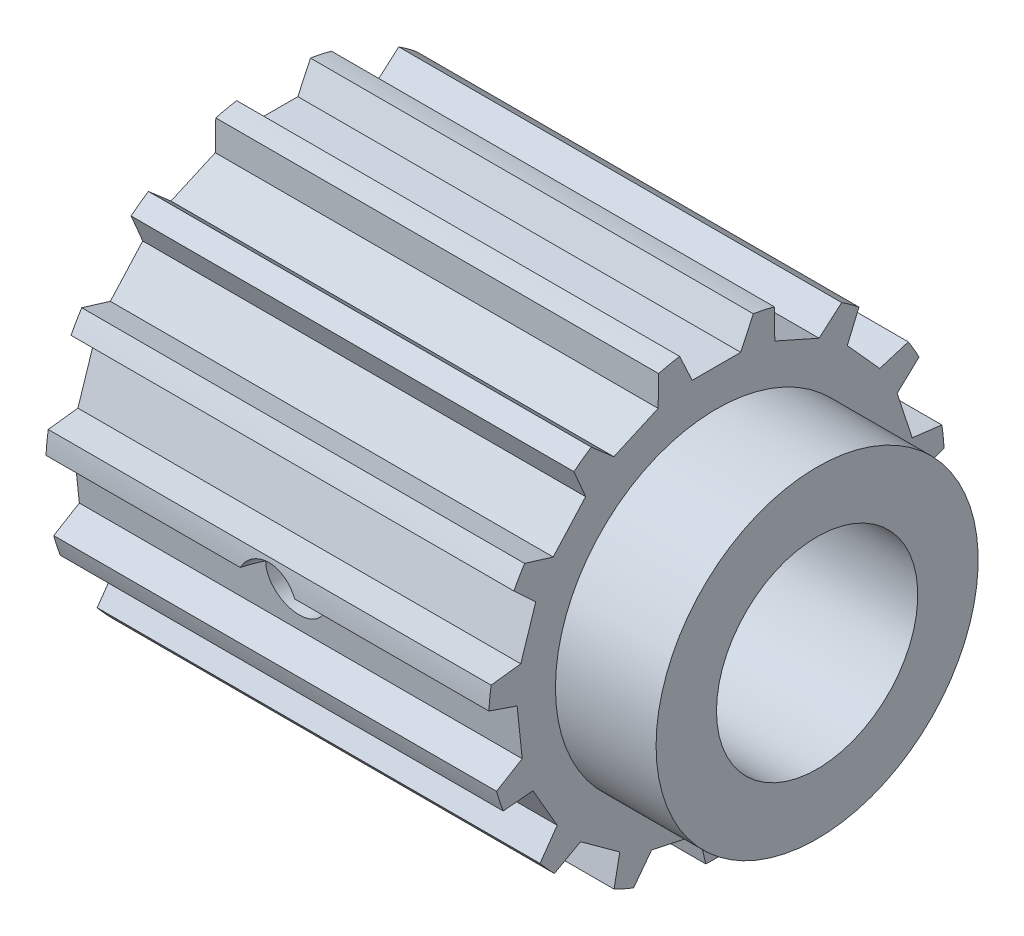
from build123d import *

# Parameters (mm, degrees)
ENL_V_MAT_EXTRU_1_DEPTH      = 32.392853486
ENL_V_MAT_EXTRU_1_DEPTH_BACK = 32.392853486
ESQUISSE2_R                  = 1.5
ENL_V_MAT_EXTRU_2_REACH      = 33.393
R_P_TITION_CIRCULAIRE1_COUNT = 15


with BuildPart() as part:
    # Esquisse1 → R_volution1 (revolve)
    with BuildSketch(Plane.XY, mode=Mode.PRIVATE) as r_volution1_sk:
        Polygon((0, 5), (0, 8), (-5, 8), (-5, 11.325), (-27, 11.325), (-27, 5), align=None)
    revolve(r_volution1_sk.sketch.rotate(Axis((-12.25475793, 0, 0), (1, 0, 0)), 90), axis=Axis((-12.25475793, 0, 0), (1, 0, 0)))

    # Esquisse2 → Enl_v. mat.-Extru.1 (cut, two sides: drawn at the far end of the back side and taken through both)
    with BuildSketch(Plane.XY.offset(-ENL_V_MAT_EXTRU_1_DEPTH_BACK)):
        with Locations((-16, 0)):
            Circle(ESQUISSE2_R)
    extrude(amount=ENL_V_MAT_EXTRU_1_DEPTH + ENL_V_MAT_EXTRU_1_DEPTH_BACK, mode=Mode.SUBTRACT)

    # Esquisse3 → Enl_v. mat.-Extru.2 (cut, up to next)
    with BuildSketch(Plane.ZY.offset(27), mode=Mode.PRIVATE) as enl_v_mat_extru_2_sk1:
        with BuildLine():
            Line((-2.16, 11.88023674), (-1.204069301, 9.83023674))
            Line((-1.204069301, 9.83023674), (1.204069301, 9.83023674))
            Line((1.204069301, 9.83023674), (2.16, 11.88023674))
            ThreePointArc((2.16, 11.88023674), (0, 12.075), (-2.16, 11.88023674))
        make_face()
    enl_v_mat_extru_2_tool1 = extrude(enl_v_mat_extru_2_sk1.sketch, amount=-ENL_V_MAT_EXTRU_2_REACH, mode=Mode.PRIVATE) & part.part
    enl_v_mat_extru_2 = enl_v_mat_extru_2_tool1.solids().sort_by_distance((-27, 11.028097, 0))[0]
    add(enl_v_mat_extru_2, mode=Mode.SUBTRACT)

    # R_p_tition circulaire1: Enl_v. mat.-Extru.2 ×15 about axis
    r_p_tition_circulaire1_axis = Axis((0, 0, 0), (1, 0, 0))
    for i in range(1, R_P_TITION_CIRCULAIRE1_COUNT):
        add(enl_v_mat_extru_2.rotate(r_p_tition_circulaire1_axis, i * 360 / R_P_TITION_CIRCULAIRE1_COUNT), mode=Mode.SUBTRACT)


solid = part.part
